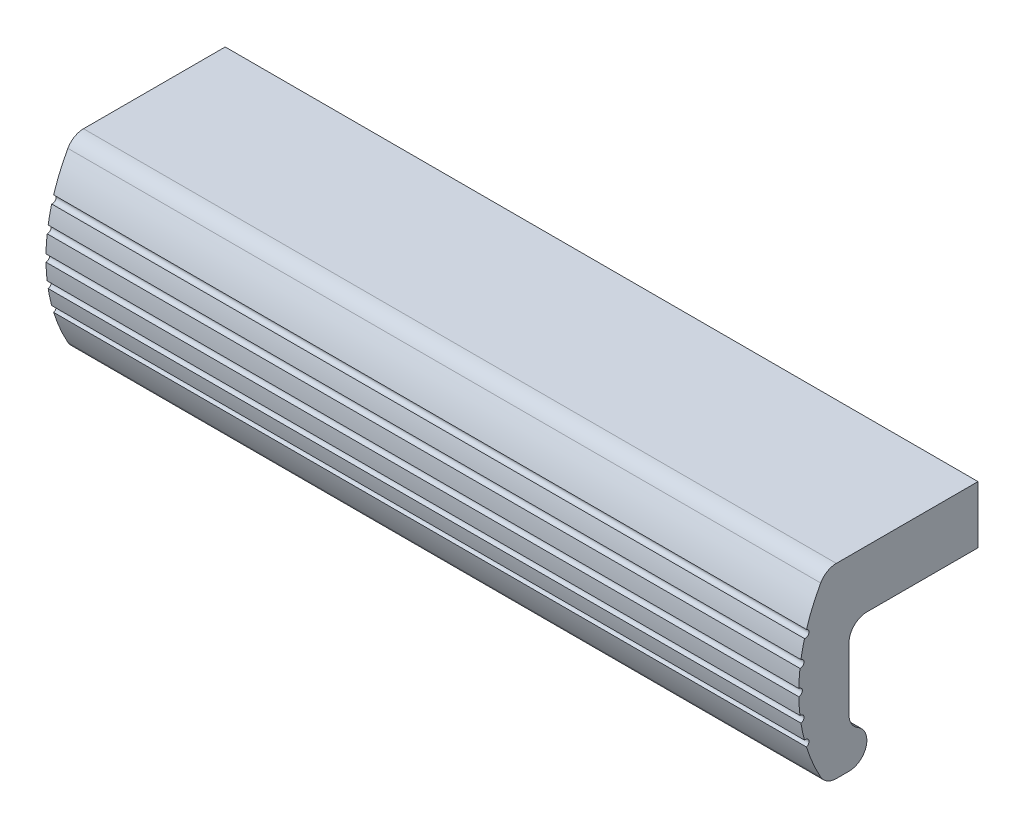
ISO-10303-21;
HEADER;
FILE_DESCRIPTION(('STEP AP214'),'2;1');
FILE_NAME('part.step','',(''),(''),'','','');
FILE_SCHEMA(('AUTOMOTIVE_DESIGN { 1 0 10303 214 1 1 1 1 }'));
ENDSEC;
DATA;
#1=APPLICATION_CONTEXT('core data for automotive mechanical design processes');
#2=APPLICATION_PROTOCOL_DEFINITION('international standard','automotive_design',2000,#1);
#3=PRODUCT_CONTEXT('',#1,'mechanical');
#4=PRODUCT('Part','Part','',(#3));
#5=PRODUCT_RELATED_PRODUCT_CATEGORY('part','',(#4));
#6=PRODUCT_DEFINITION_FORMATION('','',#4);
#7=PRODUCT_DEFINITION_CONTEXT('part definition',#1,'design');
#8=PRODUCT_DEFINITION('design','',#6,#7);
#9=PRODUCT_DEFINITION_SHAPE('','',#8);
#10=(LENGTH_UNIT() NAMED_UNIT(*) SI_UNIT(.MILLI.,.METRE.));
#11=(NAMED_UNIT(*) PLANE_ANGLE_UNIT() SI_UNIT($,.RADIAN.));
#12=(NAMED_UNIT(*) SI_UNIT($,.STERADIAN.) SOLID_ANGLE_UNIT());
#13=UNCERTAINTY_MEASURE_WITH_UNIT(LENGTH_MEASURE(1.E-05),#10,'distance_accuracy_value','');
#14=(GEOMETRIC_REPRESENTATION_CONTEXT(3) GLOBAL_UNCERTAINTY_ASSIGNED_CONTEXT((#13)) GLOBAL_UNIT_ASSIGNED_CONTEXT((#10,
#11,#12)) REPRESENTATION_CONTEXT('',''));
#15=CARTESIAN_POINT('',(0.,0.,0.));
#16=DIRECTION('',(0.,0.,1.));
#17=DIRECTION('',(1.,0.,0.));
#18=AXIS2_PLACEMENT_3D('',#15,#16,#17);
#19=CARTESIAN_POINT('',(-7.5,-4.,0.));
#20=DIRECTION('',(0.,1.,0.));
#21=DIRECTION('',(-1.,0.,0.));
#22=AXIS2_PLACEMENT_3D('',#19,#20,#21);
#23=PLANE('',#22);
#24=DIRECTION('',(1.,0.,0.));
#25=VECTOR('',#24,1.);
#26=CARTESIAN_POINT('',(-7.5,-4.,15.5));
#27=LINE('',#26,#25);
#28=CARTESIAN_POINT('',(-7.5,-4.,15.5));
#29=VERTEX_POINT('',#28);
#30=CARTESIAN_POINT('',(97.5,-4.,15.5));
#31=VERTEX_POINT('',#30);
#32=EDGE_CURVE('E9',#29,#31,#27,.T.);
#33=ORIENTED_EDGE('',*,*,#32,.F.);
#34=DIRECTION('',(0.,0.,1.));
#35=VECTOR('',#34,1.);
#36=CARTESIAN_POINT('',(-7.5,-4.,0.));
#37=LINE('',#36,#35);
#38=CARTESIAN_POINT('',(-7.5,-4.,0.));
#39=VERTEX_POINT('',#38);
#40=EDGE_CURVE('E232',#39,#29,#37,.T.);
#41=ORIENTED_EDGE('',*,*,#40,.F.);
#42=DIRECTION('',(1.,0.,0.));
#43=VECTOR('',#42,1.);
#44=CARTESIAN_POINT('',(-7.5,-4.,0.));
#45=LINE('',#44,#43);
#46=CARTESIAN_POINT('',(97.5,-4.,0.));
#47=VERTEX_POINT('',#46);
#48=EDGE_CURVE('E29',#39,#47,#45,.T.);
#49=ORIENTED_EDGE('',*,*,#48,.T.);
#50=DIRECTION('',(0.,0.,1.));
#51=VECTOR('',#50,1.);
#52=CARTESIAN_POINT('',(97.5,-4.,0.));
#53=LINE('',#52,#51);
#54=EDGE_CURVE('E167',#47,#31,#53,.T.);
#55=ORIENTED_EDGE('',*,*,#54,.T.);
#56=EDGE_LOOP('',(#33,#41,#49,#55));
#57=FACE_BOUND('',#56,.T.);
#58=ADVANCED_FACE('F14',(#57),#23,.F.);
#59=CARTESIAN_POINT('',(-7.5,-6.5,15.5));
#60=DIRECTION('',(1.,0.,0.));
#61=DIRECTION('',(0.,0.,-1.));
#62=AXIS2_PLACEMENT_3D('',#59,#60,#61);
#63=CYLINDRICAL_SURFACE('',#62,2.5);
#64=DIRECTION('',(1.,0.,0.));
#65=VECTOR('',#64,1.);
#66=CARTESIAN_POINT('',(-7.5,-6.5,18.));
#67=LINE('',#66,#65);
#68=CARTESIAN_POINT('',(-7.5,-6.5,18.));
#69=VERTEX_POINT('',#68);
#70=CARTESIAN_POINT('',(97.5,-6.5,18.));
#71=VERTEX_POINT('',#70);
#72=EDGE_CURVE('E22',#69,#71,#67,.T.);
#73=ORIENTED_EDGE('',*,*,#72,.F.);
#74=CARTESIAN_POINT('',(-7.5,-6.5,15.5));
#75=DIRECTION('',(-1.,0.,0.));
#76=DIRECTION('',(0.,0.,1.));
#77=AXIS2_PLACEMENT_3D('',#74,#75,#76);
#78=CIRCLE('',#77,2.5);
#79=EDGE_CURVE('E163',#69,#29,#78,.T.);
#80=ORIENTED_EDGE('',*,*,#79,.T.);
#81=ORIENTED_EDGE('',*,*,#32,.T.);
#82=CARTESIAN_POINT('',(97.5,-6.5,15.5));
#83=DIRECTION('',(-1.,0.,0.));
#84=DIRECTION('',(0.,0.,1.));
#85=AXIS2_PLACEMENT_3D('',#82,#83,#84);
#86=CIRCLE('',#85,2.5);
#87=EDGE_CURVE('E160',#71,#31,#86,.T.);
#88=ORIENTED_EDGE('',*,*,#87,.F.);
#89=EDGE_LOOP('',(#73,#80,#81,#88));
#90=FACE_BOUND('',#89,.T.);
#91=ADVANCED_FACE('F16',(#90),#63,.F.);
#92=CARTESIAN_POINT('',(-7.5,-6.5,18.));
#93=DIRECTION('',(0.,0.,1.));
#94=DIRECTION('',(1.,0.,0.));
#95=AXIS2_PLACEMENT_3D('',#92,#93,#94);
#96=PLANE('',#95);
#97=DIRECTION('',(1.,0.,0.));
#98=VECTOR('',#97,1.);
#99=CARTESIAN_POINT('',(-7.5,-15.1698729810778,18.));
#100=LINE('',#99,#98);
#101=CARTESIAN_POINT('',(-7.5,-15.1698729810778,18.));
#102=VERTEX_POINT('',#101);
#103=CARTESIAN_POINT('',(97.5,-15.1698729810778,18.));
#104=VERTEX_POINT('',#103);
#105=EDGE_CURVE('E324',#102,#104,#100,.T.);
#106=ORIENTED_EDGE('',*,*,#105,.F.);
#107=DIRECTION('',(0.,-1.,0.));
#108=VECTOR('',#107,1.);
#109=CARTESIAN_POINT('',(-7.5,-6.5,18.));
#110=LINE('',#109,#108);
#111=EDGE_CURVE('E235',#69,#102,#110,.T.);
#112=ORIENTED_EDGE('',*,*,#111,.F.);
#113=ORIENTED_EDGE('',*,*,#72,.T.);
#114=DIRECTION('',(0.,-1.,0.));
#115=VECTOR('',#114,1.);
#116=CARTESIAN_POINT('',(97.5,-6.5,18.));
#117=LINE('',#116,#115);
#118=EDGE_CURVE('E175',#71,#104,#117,.T.);
#119=ORIENTED_EDGE('',*,*,#118,.T.);
#120=EDGE_LOOP('',(#106,#112,#113,#119));
#121=FACE_BOUND('',#120,.T.);
#122=ADVANCED_FACE('F327',(#121),#96,.F.);
#123=CARTESIAN_POINT('',(-7.5,-15.1698729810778,15.5));
#124=DIRECTION('',(1.,0.,0.));
#125=DIRECTION('',(0.,0.,-1.));
#126=AXIS2_PLACEMENT_3D('',#123,#124,#125);
#127=CYLINDRICAL_SURFACE('',#126,2.5);
#128=DIRECTION('',(1.,0.,0.));
#129=VECTOR('',#128,1.);
#130=CARTESIAN_POINT('',(-7.5,-17.334936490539,16.75));
#131=LINE('',#130,#129);
#132=CARTESIAN_POINT('',(-7.5,-17.334936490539,16.75));
#133=VERTEX_POINT('',#132);
#134=CARTESIAN_POINT('',(97.5,-17.334936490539,16.75));
#135=VERTEX_POINT('',#134);
#136=EDGE_CURVE('E322',#133,#135,#131,.T.);
#137=ORIENTED_EDGE('',*,*,#136,.F.);
#138=CARTESIAN_POINT('',(-7.5,-15.1698729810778,15.5));
#139=DIRECTION('',(-1.,0.,0.));
#140=DIRECTION('',(0.,0.,1.));
#141=AXIS2_PLACEMENT_3D('',#138,#139,#140);
#142=CIRCLE('',#141,2.5);
#143=EDGE_CURVE('E238',#133,#102,#142,.T.);
#144=ORIENTED_EDGE('',*,*,#143,.T.);
#145=ORIENTED_EDGE('',*,*,#105,.T.);
#146=CARTESIAN_POINT('',(97.5,-15.1698729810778,15.5));
#147=DIRECTION('',(-1.,0.,0.));
#148=DIRECTION('',(0.,0.,1.));
#149=AXIS2_PLACEMENT_3D('',#146,#147,#148);
#150=CIRCLE('',#149,2.5);
#151=EDGE_CURVE('E177',#135,#104,#150,.T.);
#152=ORIENTED_EDGE('',*,*,#151,.F.);
#153=EDGE_LOOP('',(#137,#144,#145,#152));
#154=FACE_BOUND('',#153,.T.);
#155=ADVANCED_FACE('F396',(#154),#127,.F.);
#156=CARTESIAN_POINT('',(-7.5,-19.5,18.));
#157=DIRECTION('',(1.,0.,0.));
#158=DIRECTION('',(0.,0.,-1.));
#159=AXIS2_PLACEMENT_3D('',#156,#157,#158);
#160=CYLINDRICAL_SURFACE('',#159,2.5);
#161=DIRECTION('',(1.,0.,0.));
#162=VECTOR('',#161,1.);
#163=CARTESIAN_POINT('',(-7.5,-22.,18.));
#164=LINE('',#163,#162);
#165=CARTESIAN_POINT('',(-7.5,-22.,18.));
#166=VERTEX_POINT('',#165);
#167=CARTESIAN_POINT('',(97.5,-22.,18.));
#168=VERTEX_POINT('',#167);
#169=EDGE_CURVE('E320',#166,#168,#164,.T.);
#170=ORIENTED_EDGE('',*,*,#169,.F.);
#171=CARTESIAN_POINT('',(-7.5,-19.5,18.));
#172=DIRECTION('',(-1.,0.,0.));
#173=DIRECTION('',(0.,0.,1.));
#174=AXIS2_PLACEMENT_3D('',#171,#172,#173);
#175=CIRCLE('',#174,2.5);
#176=EDGE_CURVE('E241',#133,#166,#175,.T.);
#177=ORIENTED_EDGE('',*,*,#176,.F.);
#178=ORIENTED_EDGE('',*,*,#136,.T.);
#179=CARTESIAN_POINT('',(97.5,-19.5,18.));
#180=DIRECTION('',(-1.,0.,0.));
#181=DIRECTION('',(0.,0.,1.));
#182=AXIS2_PLACEMENT_3D('',#179,#180,#181);
#183=CIRCLE('',#182,2.5);
#184=EDGE_CURVE('E182',#135,#168,#183,.T.);
#185=ORIENTED_EDGE('',*,*,#184,.T.);
#186=EDGE_LOOP('',(#170,#177,#178,#185));
#187=FACE_BOUND('',#186,.T.);
#188=ADVANCED_FACE('F393',(#187),#160,.T.);
#189=CARTESIAN_POINT('',(-7.5,-22.,18.));
#190=DIRECTION('',(0.,1.,0.));
#191=DIRECTION('',(-1.,0.,0.));
#192=AXIS2_PLACEMENT_3D('',#189,#190,#191);
#193=PLANE('',#192);
#194=DIRECTION('',(1.,0.,0.));
#195=VECTOR('',#194,1.);
#196=CARTESIAN_POINT('',(-7.5,-22.,19.7616630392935));
#197=LINE('',#196,#195);
#198=CARTESIAN_POINT('',(-7.5,-22.,19.7616630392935));
#199=VERTEX_POINT('',#198);
#200=CARTESIAN_POINT('',(97.5,-22.,19.7616630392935));
#201=VERTEX_POINT('',#200);
#202=EDGE_CURVE('E318',#199,#201,#197,.T.);
#203=ORIENTED_EDGE('',*,*,#202,.F.);
#204=DIRECTION('',(0.,0.,1.));
#205=VECTOR('',#204,1.);
#206=CARTESIAN_POINT('',(-7.5,-22.,18.));
#207=LINE('',#206,#205);
#208=EDGE_CURVE('E244',#166,#199,#207,.T.);
#209=ORIENTED_EDGE('',*,*,#208,.F.);
#210=ORIENTED_EDGE('',*,*,#169,.T.);
#211=DIRECTION('',(0.,0.,1.));
#212=VECTOR('',#211,1.);
#213=CARTESIAN_POINT('',(97.5,-22.,18.));
#214=LINE('',#213,#212);
#215=EDGE_CURVE('E185',#168,#201,#214,.T.);
#216=ORIENTED_EDGE('',*,*,#215,.T.);
#217=EDGE_LOOP('',(#203,#209,#210,#216));
#218=FACE_BOUND('',#217,.T.);
#219=ADVANCED_FACE('F390',(#218),#193,.F.);
#220=CARTESIAN_POINT('',(-7.5,-19.5,19.7616630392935));
#221=DIRECTION('',(1.,0.,0.));
#222=DIRECTION('',(0.,0.,-1.));
#223=AXIS2_PLACEMENT_3D('',#220,#221,#222);
#224=CYLINDRICAL_SURFACE('',#223,2.5);
#225=DIRECTION('',(1.,0.,0.));
#226=VECTOR('',#225,1.);
#227=CARTESIAN_POINT('',(-7.5,-20.720930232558,21.943251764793));
#228=LINE('',#227,#226);
#229=CARTESIAN_POINT('',(-7.5,-20.720930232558,21.943251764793));
#230=VERTEX_POINT('',#229);
#231=CARTESIAN_POINT('',(97.5,-20.720930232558,21.943251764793));
#232=VERTEX_POINT('',#231);
#233=EDGE_CURVE('E316',#230,#232,#228,.T.);
#234=ORIENTED_EDGE('',*,*,#233,.F.);
#235=CARTESIAN_POINT('',(-7.5,-19.5,19.7616630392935));
#236=DIRECTION('',(-1.,0.,0.));
#237=DIRECTION('',(0.,0.,1.));
#238=AXIS2_PLACEMENT_3D('',#235,#236,#237);
#239=CIRCLE('',#238,2.5);
#240=EDGE_CURVE('E247',#199,#230,#239,.T.);
#241=ORIENTED_EDGE('',*,*,#240,.F.);
#242=ORIENTED_EDGE('',*,*,#202,.T.);
#243=CARTESIAN_POINT('',(97.5,-19.5,19.7616630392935));
#244=DIRECTION('',(-1.,0.,0.));
#245=DIRECTION('',(0.,0.,1.));
#246=AXIS2_PLACEMENT_3D('',#243,#244,#245);
#247=CIRCLE('',#246,2.5);
#248=EDGE_CURVE('E188',#201,#232,#247,.T.);
#249=ORIENTED_EDGE('',*,*,#248,.T.);
#250=EDGE_LOOP('',(#234,#241,#242,#249));
#251=FACE_BOUND('',#250,.T.);
#252=ADVANCED_FACE('F386',(#251),#224,.T.);
#253=CARTESIAN_POINT('',(-7.5,-9.,1.));
#254=DIRECTION('',(1.,0.,0.));
#255=DIRECTION('',(0.,0.,-1.));
#256=AXIS2_PLACEMENT_3D('',#253,#254,#255);
#257=CYLINDRICAL_SURFACE('',#256,24.);
#258=DIRECTION('',(1.,0.,0.));
#259=VECTOR('',#258,1.);
#260=CARTESIAN_POINT('',(-7.5,-16.094465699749,23.9274629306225));
#261=LINE('',#260,#259);
#262=CARTESIAN_POINT('',(-7.5,-16.094465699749,23.9274629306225));
#263=VERTEX_POINT('',#262);
#264=CARTESIAN_POINT('',(97.5,-16.094465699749,23.9274629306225));
#265=VERTEX_POINT('',#264);
#266=EDGE_CURVE('E314',#263,#265,#261,.T.);
#267=ORIENTED_EDGE('',*,*,#266,.F.);
#268=CARTESIAN_POINT('',(-7.5,-9.,1.));
#269=DIRECTION('',(-1.,0.,0.));
#270=DIRECTION('',(0.,0.,1.));
#271=AXIS2_PLACEMENT_3D('',#268,#269,#270);
#272=CIRCLE('',#271,24.);
#273=EDGE_CURVE('E250',#230,#263,#272,.T.);
#274=ORIENTED_EDGE('',*,*,#273,.F.);
#275=ORIENTED_EDGE('',*,*,#233,.T.);
#276=CARTESIAN_POINT('',(97.5,-9.,1.));
#277=DIRECTION('',(-1.,0.,0.));
#278=DIRECTION('',(0.,0.,1.));
#279=AXIS2_PLACEMENT_3D('',#276,#277,#278);
#280=CIRCLE('',#279,24.);
#281=EDGE_CURVE('E191',#232,#265,#280,.T.);
#282=ORIENTED_EDGE('',*,*,#281,.T.);
#283=EDGE_LOOP('',(#267,#274,#275,#282));
#284=FACE_BOUND('',#283,.T.);
#285=ADVANCED_FACE('F381',(#284),#257,.T.);
#286=CARTESIAN_POINT('',(-7.5,-15.615296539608,24.0702807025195));
#287=DIRECTION('',(1.,0.,0.));
#288=DIRECTION('',(0.,0.,-1.));
#289=AXIS2_PLACEMENT_3D('',#286,#287,#288);
#290=CYLINDRICAL_SURFACE('',#289,0.5);
#291=DIRECTION('',(1.,0.,0.));
#292=VECTOR('',#291,1.);
#293=CARTESIAN_POINT('',(-7.5,-15.1332561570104,24.2030853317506));
#294=LINE('',#293,#292);
#295=CARTESIAN_POINT('',(-7.5,-15.1332561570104,24.2030853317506));
#296=VERTEX_POINT('',#295);
#297=CARTESIAN_POINT('',(97.5,-15.1332561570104,24.2030853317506));
#298=VERTEX_POINT('',#297);
#299=EDGE_CURVE('E312',#296,#298,#294,.T.);
#300=ORIENTED_EDGE('',*,*,#299,.F.);
#301=CARTESIAN_POINT('',(-7.5,-15.615296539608,24.0702807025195));
#302=DIRECTION('',(-1.,0.,0.));
#303=DIRECTION('',(0.,0.,1.));
#304=AXIS2_PLACEMENT_3D('',#301,#302,#303);
#305=CIRCLE('',#304,0.5);
#306=EDGE_CURVE('E253',#296,#263,#305,.T.);
#307=ORIENTED_EDGE('',*,*,#306,.T.);
#308=ORIENTED_EDGE('',*,*,#266,.T.);
#309=CARTESIAN_POINT('',(97.5,-15.615296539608,24.0702807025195));
#310=DIRECTION('',(-1.,0.,0.));
#311=DIRECTION('',(0.,0.,1.));
#312=AXIS2_PLACEMENT_3D('',#309,#310,#311);
#313=CIRCLE('',#312,0.5);
#314=EDGE_CURVE('E194',#298,#265,#313,.T.);
#315=ORIENTED_EDGE('',*,*,#314,.F.);
#316=EDGE_LOOP('',(#300,#307,#308,#315));
#317=FACE_BOUND('',#316,.T.);
#318=ADVANCED_FACE('F378',(#317),#290,.F.);
#319=CARTESIAN_POINT('',(-7.5,-9.,1.));
#320=DIRECTION('',(1.,0.,0.));
#321=DIRECTION('',(0.,0.,-1.));
#322=AXIS2_PLACEMENT_3D('',#319,#320,#321);
#323=CYLINDRICAL_SURFACE('',#322,24.);
#324=DIRECTION('',(1.,0.,0.));
#325=VECTOR('',#324,1.);
#326=CARTESIAN_POINT('',(-7.5,-12.8345367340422,24.6916932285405));
#327=LINE('',#326,#325);
#328=CARTESIAN_POINT('',(-7.5,-12.8345367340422,24.6916932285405));
#329=VERTEX_POINT('',#328);
#330=CARTESIAN_POINT('',(97.5,-12.8345367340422,24.6916932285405));
#331=VERTEX_POINT('',#330);
#332=EDGE_CURVE('E310',#329,#331,#327,.T.);
#333=ORIENTED_EDGE('',*,*,#332,.F.);
#334=CARTESIAN_POINT('',(-7.5,-9.,1.));
#335=DIRECTION('',(-1.,0.,0.));
#336=DIRECTION('',(0.,0.,1.));
#337=AXIS2_PLACEMENT_3D('',#334,#335,#336);
#338=CIRCLE('',#337,24.);
#339=EDGE_CURVE('E256',#296,#329,#338,.T.);
#340=ORIENTED_EDGE('',*,*,#339,.F.);
#341=ORIENTED_EDGE('',*,*,#299,.T.);
#342=CARTESIAN_POINT('',(97.5,-9.,1.));
#343=DIRECTION('',(-1.,0.,0.));
#344=DIRECTION('',(0.,0.,1.));
#345=AXIS2_PLACEMENT_3D('',#342,#343,#344);
#346=CIRCLE('',#345,24.);
#347=EDGE_CURVE('E197',#298,#331,#346,.T.);
#348=ORIENTED_EDGE('',*,*,#347,.T.);
#349=EDGE_LOOP('',(#333,#340,#341,#348));
#350=FACE_BOUND('',#349,.T.);
#351=ADVANCED_FACE('F374',(#350),#323,.T.);
#352=CARTESIAN_POINT('',(-7.5,-12.3401544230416,24.7664336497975));
#353=DIRECTION('',(1.,0.,0.));
#354=DIRECTION('',(0.,0.,-1.));
#355=AXIS2_PLACEMENT_3D('',#352,#353,#354);
#356=CYLINDRICAL_SURFACE('',#355,0.5);
#357=DIRECTION('',(1.,0.,0.));
#358=VECTOR('',#357,1.);
#359=CARTESIAN_POINT('',(-7.5,-11.8443223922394,24.830858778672));
#360=LINE('',#359,#358);
#361=CARTESIAN_POINT('',(-7.5,-11.8443223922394,24.830858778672));
#362=VERTEX_POINT('',#361);
#363=CARTESIAN_POINT('',(97.5,-11.8443223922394,24.830858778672));
#364=VERTEX_POINT('',#363);
#365=EDGE_CURVE('E308',#362,#364,#360,.T.);
#366=ORIENTED_EDGE('',*,*,#365,.F.);
#367=CARTESIAN_POINT('',(-7.5,-12.3401544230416,24.7664336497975));
#368=DIRECTION('',(-1.,0.,0.));
#369=DIRECTION('',(0.,0.,1.));
#370=AXIS2_PLACEMENT_3D('',#367,#368,#369);
#371=CIRCLE('',#370,0.5);
#372=EDGE_CURVE('E259',#362,#329,#371,.T.);
#373=ORIENTED_EDGE('',*,*,#372,.T.);
#374=ORIENTED_EDGE('',*,*,#332,.T.);
#375=CARTESIAN_POINT('',(97.5,-12.3401544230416,24.7664336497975));
#376=DIRECTION('',(-1.,0.,0.));
#377=DIRECTION('',(0.,0.,1.));
#378=AXIS2_PLACEMENT_3D('',#375,#376,#377);
#379=CIRCLE('',#378,0.5);
#380=EDGE_CURVE('E200',#364,#331,#379,.T.);
#381=ORIENTED_EDGE('',*,*,#380,.F.);
#382=EDGE_LOOP('',(#366,#373,#374,#381));
#383=FACE_BOUND('',#382,.T.);
#384=ADVANCED_FACE('F369',(#383),#356,.F.);
#385=CARTESIAN_POINT('',(-7.5,-9.,1.));
#386=DIRECTION('',(1.,0.,0.));
#387=DIRECTION('',(0.,0.,-1.));
#388=AXIS2_PLACEMENT_3D('',#385,#386,#387);
#389=CYLINDRICAL_SURFACE('',#388,24.);
#390=DIRECTION('',(1.,0.,0.));
#391=VECTOR('',#390,1.);
#392=CARTESIAN_POINT('',(-7.5,-9.49997287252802,24.9947916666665));
#393=LINE('',#392,#391);
#394=CARTESIAN_POINT('',(-7.5,-9.49997287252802,24.9947916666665));
#395=VERTEX_POINT('',#394);
#396=CARTESIAN_POINT('',(97.5,-9.49997287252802,24.9947916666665));
#397=VERTEX_POINT('',#396);
#398=EDGE_CURVE('E306',#395,#397,#393,.T.);
#399=ORIENTED_EDGE('',*,*,#398,.F.);
#400=CARTESIAN_POINT('',(-7.5,-9.,1.));
#401=DIRECTION('',(-1.,0.,0.));
#402=DIRECTION('',(0.,0.,1.));
#403=AXIS2_PLACEMENT_3D('',#400,#401,#402);
#404=CIRCLE('',#403,24.);
#405=EDGE_CURVE('E262',#362,#395,#404,.T.);
#406=ORIENTED_EDGE('',*,*,#405,.F.);
#407=ORIENTED_EDGE('',*,*,#365,.T.);
#408=CARTESIAN_POINT('',(97.5,-9.,1.));
#409=DIRECTION('',(-1.,0.,0.));
#410=DIRECTION('',(0.,0.,1.));
#411=AXIS2_PLACEMENT_3D('',#408,#409,#410);
#412=CIRCLE('',#411,24.);
#413=EDGE_CURVE('E203',#364,#397,#412,.T.);
#414=ORIENTED_EDGE('',*,*,#413,.T.);
#415=EDGE_LOOP('',(#399,#406,#407,#414));
#416=FACE_BOUND('',#415,.T.);
#417=ADVANCED_FACE('F365',(#416),#389,.T.);
#418=CARTESIAN_POINT('',(-7.5,-9.,25.));
#419=DIRECTION('',(1.,0.,0.));
#420=DIRECTION('',(0.,0.,-1.));
#421=AXIS2_PLACEMENT_3D('',#418,#419,#420);
#422=CYLINDRICAL_SURFACE('',#421,0.500000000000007);
#423=DIRECTION('',(1.,0.,0.));
#424=VECTOR('',#423,1.);
#425=CARTESIAN_POINT('',(-7.5,-8.50002712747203,24.9947916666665));
#426=LINE('',#425,#424);
#427=CARTESIAN_POINT('',(-7.5,-8.50002712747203,24.9947916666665));
#428=VERTEX_POINT('',#427);
#429=CARTESIAN_POINT('',(97.5,-8.50002712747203,24.9947916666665));
#430=VERTEX_POINT('',#429);
#431=EDGE_CURVE('E304',#428,#430,#426,.T.);
#432=ORIENTED_EDGE('',*,*,#431,.F.);
#433=CARTESIAN_POINT('',(-7.5,-9.,25.));
#434=DIRECTION('',(-1.,0.,0.));
#435=DIRECTION('',(0.,0.,1.));
#436=AXIS2_PLACEMENT_3D('',#433,#434,#435);
#437=CIRCLE('',#436,0.500000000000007);
#438=EDGE_CURVE('E265',#428,#395,#437,.T.);
#439=ORIENTED_EDGE('',*,*,#438,.T.);
#440=ORIENTED_EDGE('',*,*,#398,.T.);
#441=CARTESIAN_POINT('',(97.5,-9.,25.));
#442=DIRECTION('',(-1.,0.,0.));
#443=DIRECTION('',(0.,0.,1.));
#444=AXIS2_PLACEMENT_3D('',#441,#442,#443);
#445=CIRCLE('',#444,0.500000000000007);
#446=EDGE_CURVE('E206',#430,#397,#445,.T.);
#447=ORIENTED_EDGE('',*,*,#446,.F.);
#448=EDGE_LOOP('',(#432,#439,#440,#447));
#449=FACE_BOUND('',#448,.T.);
#450=ADVANCED_FACE('F361',(#449),#422,.F.);
#451=CARTESIAN_POINT('',(-7.5,-9.,1.));
#452=DIRECTION('',(1.,0.,0.));
#453=DIRECTION('',(0.,0.,-1.));
#454=AXIS2_PLACEMENT_3D('',#451,#452,#453);
#455=CYLINDRICAL_SURFACE('',#454,24.);
#456=DIRECTION('',(1.,0.,0.));
#457=VECTOR('',#456,1.);
#458=CARTESIAN_POINT('',(-7.5,-6.15567760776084,24.830858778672));
#459=LINE('',#458,#457);
#460=CARTESIAN_POINT('',(-7.5,-6.15567760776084,24.830858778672));
#461=VERTEX_POINT('',#460);
#462=CARTESIAN_POINT('',(97.5,-6.15567760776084,24.830858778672));
#463=VERTEX_POINT('',#462);
#464=EDGE_CURVE('E302',#461,#463,#459,.T.);
#465=ORIENTED_EDGE('',*,*,#464,.F.);
#466=CARTESIAN_POINT('',(-7.5,-9.,1.));
#467=DIRECTION('',(-1.,0.,0.));
#468=DIRECTION('',(0.,0.,1.));
#469=AXIS2_PLACEMENT_3D('',#466,#467,#468);
#470=CIRCLE('',#469,24.);
#471=EDGE_CURVE('E268',#428,#461,#470,.T.);
#472=ORIENTED_EDGE('',*,*,#471,.F.);
#473=ORIENTED_EDGE('',*,*,#431,.T.);
#474=CARTESIAN_POINT('',(97.5,-9.,1.));
#475=DIRECTION('',(-1.,0.,0.));
#476=DIRECTION('',(0.,0.,1.));
#477=AXIS2_PLACEMENT_3D('',#474,#475,#476);
#478=CIRCLE('',#477,24.);
#479=EDGE_CURVE('E209',#430,#463,#478,.T.);
#480=ORIENTED_EDGE('',*,*,#479,.T.);
#481=EDGE_LOOP('',(#465,#472,#473,#480));
#482=FACE_BOUND('',#481,.T.);
#483=ADVANCED_FACE('F357',(#482),#455,.T.);
#484=CARTESIAN_POINT('',(-7.5,-5.65984557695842,24.7664336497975));
#485=DIRECTION('',(1.,0.,0.));
#486=DIRECTION('',(0.,0.,-1.));
#487=AXIS2_PLACEMENT_3D('',#484,#485,#486);
#488=CYLINDRICAL_SURFACE('',#487,0.499999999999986);
#489=DIRECTION('',(1.,0.,0.));
#490=VECTOR('',#489,1.);
#491=CARTESIAN_POINT('',(-7.5,-5.16546326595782,24.6916932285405));
#492=LINE('',#491,#490);
#493=CARTESIAN_POINT('',(-7.5,-5.16546326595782,24.6916932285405));
#494=VERTEX_POINT('',#493);
#495=CARTESIAN_POINT('',(97.5,-5.16546326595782,24.6916932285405));
#496=VERTEX_POINT('',#495);
#497=EDGE_CURVE('E300',#494,#496,#492,.T.);
#498=ORIENTED_EDGE('',*,*,#497,.F.);
#499=CARTESIAN_POINT('',(-7.5,-5.65984557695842,24.7664336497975));
#500=DIRECTION('',(-1.,0.,0.));
#501=DIRECTION('',(0.,0.,1.));
#502=AXIS2_PLACEMENT_3D('',#499,#500,#501);
#503=CIRCLE('',#502,0.499999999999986);
#504=EDGE_CURVE('E271',#494,#461,#503,.T.);
#505=ORIENTED_EDGE('',*,*,#504,.T.);
#506=ORIENTED_EDGE('',*,*,#464,.T.);
#507=CARTESIAN_POINT('',(97.5,-5.65984557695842,24.7664336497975));
#508=DIRECTION('',(-1.,0.,0.));
#509=DIRECTION('',(0.,0.,1.));
#510=AXIS2_PLACEMENT_3D('',#507,#508,#509);
#511=CIRCLE('',#510,0.499999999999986);
#512=EDGE_CURVE('E212',#496,#463,#511,.T.);
#513=ORIENTED_EDGE('',*,*,#512,.F.);
#514=EDGE_LOOP('',(#498,#505,#506,#513));
#515=FACE_BOUND('',#514,.T.);
#516=ADVANCED_FACE('F354',(#515),#488,.F.);
#517=CARTESIAN_POINT('',(-7.5,-9.,1.));
#518=DIRECTION('',(1.,0.,0.));
#519=DIRECTION('',(0.,0.,-1.));
#520=AXIS2_PLACEMENT_3D('',#517,#518,#519);
#521=CYLINDRICAL_SURFACE('',#520,24.);
#522=DIRECTION('',(1.,0.,0.));
#523=VECTOR('',#522,1.);
#524=CARTESIAN_POINT('',(-7.5,-2.8667438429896,24.2030853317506));
#525=LINE('',#524,#523);
#526=CARTESIAN_POINT('',(-7.5,-2.8667438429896,24.2030853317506));
#527=VERTEX_POINT('',#526);
#528=CARTESIAN_POINT('',(97.5,-2.8667438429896,24.2030853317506));
#529=VERTEX_POINT('',#528);
#530=EDGE_CURVE('E298',#527,#529,#525,.T.);
#531=ORIENTED_EDGE('',*,*,#530,.F.);
#532=CARTESIAN_POINT('',(-7.5,-9.,1.));
#533=DIRECTION('',(-1.,0.,0.));
#534=DIRECTION('',(0.,0.,1.));
#535=AXIS2_PLACEMENT_3D('',#532,#533,#534);
#536=CIRCLE('',#535,24.);
#537=EDGE_CURVE('E274',#494,#527,#536,.T.);
#538=ORIENTED_EDGE('',*,*,#537,.F.);
#539=ORIENTED_EDGE('',*,*,#497,.T.);
#540=CARTESIAN_POINT('',(97.5,-9.,1.));
#541=DIRECTION('',(-1.,0.,0.));
#542=DIRECTION('',(0.,0.,1.));
#543=AXIS2_PLACEMENT_3D('',#540,#541,#542);
#544=CIRCLE('',#543,24.);
#545=EDGE_CURVE('E215',#496,#529,#544,.T.);
#546=ORIENTED_EDGE('',*,*,#545,.T.);
#547=EDGE_LOOP('',(#531,#538,#539,#546));
#548=FACE_BOUND('',#547,.T.);
#549=ADVANCED_FACE('F350',(#548),#521,.T.);
#550=CARTESIAN_POINT('',(-7.5,-2.38470346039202,24.0702807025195));
#551=DIRECTION('',(1.,0.,0.));
#552=DIRECTION('',(0.,0.,-1.));
#553=AXIS2_PLACEMENT_3D('',#550,#551,#552);
#554=CYLINDRICAL_SURFACE('',#553,0.500000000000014);
#555=DIRECTION('',(1.,0.,0.));
#556=VECTOR('',#555,1.);
#557=CARTESIAN_POINT('',(-7.5,-1.90553430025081,23.9274629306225));
#558=LINE('',#557,#556);
#559=CARTESIAN_POINT('',(-7.5,-1.90553430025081,23.9274629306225));
#560=VERTEX_POINT('',#559);
#561=CARTESIAN_POINT('',(97.5,-1.90553430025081,23.9274629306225));
#562=VERTEX_POINT('',#561);
#563=EDGE_CURVE('E296',#560,#562,#558,.T.);
#564=ORIENTED_EDGE('',*,*,#563,.F.);
#565=CARTESIAN_POINT('',(-7.5,-2.38470346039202,24.0702807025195));
#566=DIRECTION('',(-1.,0.,0.));
#567=DIRECTION('',(0.,0.,1.));
#568=AXIS2_PLACEMENT_3D('',#565,#566,#567);
#569=CIRCLE('',#568,0.500000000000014);
#570=EDGE_CURVE('E277',#560,#527,#569,.T.);
#571=ORIENTED_EDGE('',*,*,#570,.T.);
#572=ORIENTED_EDGE('',*,*,#530,.T.);
#573=CARTESIAN_POINT('',(97.5,-2.38470346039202,24.0702807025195));
#574=DIRECTION('',(-1.,0.,0.));
#575=DIRECTION('',(0.,0.,1.));
#576=AXIS2_PLACEMENT_3D('',#573,#574,#575);
#577=CIRCLE('',#576,0.500000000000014);
#578=EDGE_CURVE('E218',#562,#529,#577,.T.);
#579=ORIENTED_EDGE('',*,*,#578,.F.);
#580=EDGE_LOOP('',(#564,#571,#572,#579));
#581=FACE_BOUND('',#580,.T.);
#582=ADVANCED_FACE('F345',(#581),#554,.F.);
#583=CARTESIAN_POINT('',(-7.5,-9.,1.));
#584=DIRECTION('',(1.,0.,0.));
#585=DIRECTION('',(0.,0.,-1.));
#586=AXIS2_PLACEMENT_3D('',#583,#584,#585);
#587=CYLINDRICAL_SURFACE('',#586,24.);
#588=DIRECTION('',(1.,0.,0.));
#589=VECTOR('',#588,1.);
#590=CARTESIAN_POINT('',(-7.5,2.72093023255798,21.943251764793));
#591=LINE('',#590,#589);
#592=CARTESIAN_POINT('',(-7.5,2.72093023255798,21.943251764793));
#593=VERTEX_POINT('',#592);
#594=CARTESIAN_POINT('',(97.5,2.72093023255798,21.943251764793));
#595=VERTEX_POINT('',#594);
#596=EDGE_CURVE('E294',#593,#595,#591,.T.);
#597=ORIENTED_EDGE('',*,*,#596,.F.);
#598=CARTESIAN_POINT('',(-7.5,-9.,1.));
#599=DIRECTION('',(-1.,0.,0.));
#600=DIRECTION('',(0.,0.,1.));
#601=AXIS2_PLACEMENT_3D('',#598,#599,#600);
#602=CIRCLE('',#601,24.);
#603=EDGE_CURVE('E280',#560,#593,#602,.T.);
#604=ORIENTED_EDGE('',*,*,#603,.F.);
#605=ORIENTED_EDGE('',*,*,#563,.T.);
#606=CARTESIAN_POINT('',(97.5,-9.,1.));
#607=DIRECTION('',(-1.,0.,0.));
#608=DIRECTION('',(0.,0.,1.));
#609=AXIS2_PLACEMENT_3D('',#606,#607,#608);
#610=CIRCLE('',#609,24.);
#611=EDGE_CURVE('E221',#562,#595,#610,.T.);
#612=ORIENTED_EDGE('',*,*,#611,.T.);
#613=EDGE_LOOP('',(#597,#604,#605,#612));
#614=FACE_BOUND('',#613,.T.);
#615=ADVANCED_FACE('F341',(#614),#587,.T.);
#616=CARTESIAN_POINT('',(-7.5,1.5,19.7616630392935));
#617=DIRECTION('',(1.,0.,0.));
#618=DIRECTION('',(0.,0.,-1.));
#619=AXIS2_PLACEMENT_3D('',#616,#617,#618);
#620=CYLINDRICAL_SURFACE('',#619,2.5);
#621=DIRECTION('',(1.,0.,0.));
#622=VECTOR('',#621,1.);
#623=CARTESIAN_POINT('',(-7.5,4.,19.7616630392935));
#624=LINE('',#623,#622);
#625=CARTESIAN_POINT('',(-7.5,4.,19.7616630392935));
#626=VERTEX_POINT('',#625);
#627=CARTESIAN_POINT('',(97.5,4.,19.7616630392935));
#628=VERTEX_POINT('',#627);
#629=EDGE_CURVE('E292',#626,#628,#624,.T.);
#630=ORIENTED_EDGE('',*,*,#629,.F.);
#631=CARTESIAN_POINT('',(-7.5,1.5,19.7616630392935));
#632=DIRECTION('',(-1.,0.,0.));
#633=DIRECTION('',(0.,0.,1.));
#634=AXIS2_PLACEMENT_3D('',#631,#632,#633);
#635=CIRCLE('',#634,2.5);
#636=EDGE_CURVE('E283',#593,#626,#635,.T.);
#637=ORIENTED_EDGE('',*,*,#636,.F.);
#638=ORIENTED_EDGE('',*,*,#596,.T.);
#639=CARTESIAN_POINT('',(97.5,1.5,19.7616630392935));
#640=DIRECTION('',(-1.,0.,0.));
#641=DIRECTION('',(0.,0.,1.));
#642=AXIS2_PLACEMENT_3D('',#639,#640,#641);
#643=CIRCLE('',#642,2.5);
#644=EDGE_CURVE('E224',#595,#628,#643,.T.);
#645=ORIENTED_EDGE('',*,*,#644,.T.);
#646=EDGE_LOOP('',(#630,#637,#638,#645));
#647=FACE_BOUND('',#646,.T.);
#648=ADVANCED_FACE('F337',(#647),#620,.T.);
#649=CARTESIAN_POINT('',(-7.5,4.,0.));
#650=DIRECTION('',(0.,1.,0.));
#651=DIRECTION('',(-1.,0.,0.));
#652=AXIS2_PLACEMENT_3D('',#649,#650,#651);
#653=PLANE('',#652);
#654=DIRECTION('',(1.,0.,0.));
#655=VECTOR('',#654,1.);
#656=CARTESIAN_POINT('',(-7.5,4.,0.));
#657=LINE('',#656,#655);
#658=CARTESIAN_POINT('',(-7.5,4.,0.));
#659=VERTEX_POINT('',#658);
#660=CARTESIAN_POINT('',(97.5,4.,0.));
#661=VERTEX_POINT('',#660);
#662=EDGE_CURVE('E37',#659,#661,#657,.T.);
#663=ORIENTED_EDGE('',*,*,#662,.F.);
#664=DIRECTION('',(0.,0.,1.));
#665=VECTOR('',#664,1.);
#666=CARTESIAN_POINT('',(-7.5,4.,0.));
#667=LINE('',#666,#665);
#668=EDGE_CURVE('E286',#659,#626,#667,.T.);
#669=ORIENTED_EDGE('',*,*,#668,.T.);
#670=ORIENTED_EDGE('',*,*,#629,.T.);
#671=DIRECTION('',(0.,0.,1.));
#672=VECTOR('',#671,1.);
#673=CARTESIAN_POINT('',(97.5,4.,0.));
#674=LINE('',#673,#672);
#675=EDGE_CURVE('E227',#661,#628,#674,.T.);
#676=ORIENTED_EDGE('',*,*,#675,.F.);
#677=EDGE_LOOP('',(#663,#669,#670,#676));
#678=FACE_BOUND('',#677,.T.);
#679=ADVANCED_FACE('F333',(#678),#653,.T.);
#680=CARTESIAN_POINT('',(-7.5,-4.,0.));
#681=DIRECTION('',(0.,0.,-1.));
#682=DIRECTION('',(-1.,0.,0.));
#683=AXIS2_PLACEMENT_3D('',#680,#681,#682);
#684=PLANE('',#683);
#685=CARTESIAN_POINT('',(0.,0.,0.));
#686=DIRECTION('',(0.,0.,-1.));
#687=DIRECTION('',(-1.,0.,0.));
#688=AXIS2_PLACEMENT_3D('',#685,#686,#687);
#689=CIRCLE('',#688,2.);
#690=CARTESIAN_POINT('',(-2.,0.,0.));
#691=VERTEX_POINT('',#690);
#692=EDGE_CURVE('E632',#691,#691,#689,.T.);
#693=ORIENTED_EDGE('',*,*,#692,.F.);
#694=EDGE_LOOP('',(#693));
#695=FACE_BOUND('',#694,.T.);
#696=CARTESIAN_POINT('',(90.,0.,0.));
#697=DIRECTION('',(0.,0.,-1.));
#698=DIRECTION('',(-1.,0.,0.));
#699=AXIS2_PLACEMENT_3D('',#696,#697,#698);
#700=CIRCLE('',#699,2.);
#701=CARTESIAN_POINT('',(88.,0.,0.));
#702=VERTEX_POINT('',#701);
#703=EDGE_CURVE('E631',#702,#702,#700,.T.);
#704=ORIENTED_EDGE('',*,*,#703,.F.);
#705=EDGE_LOOP('',(#704));
#706=FACE_BOUND('',#705,.T.);
#707=DIRECTION('',(0.,1.,0.));
#708=VECTOR('',#707,1.);
#709=CARTESIAN_POINT('',(-7.5,-4.,0.));
#710=LINE('',#709,#708);
#711=EDGE_CURVE('E288',#39,#659,#710,.T.);
#712=ORIENTED_EDGE('',*,*,#711,.T.);
#713=ORIENTED_EDGE('',*,*,#662,.T.);
#714=DIRECTION('',(0.,1.,0.));
#715=VECTOR('',#714,1.);
#716=CARTESIAN_POINT('',(97.5,-4.,0.));
#717=LINE('',#716,#715);
#718=EDGE_CURVE('E230',#47,#661,#717,.T.);
#719=ORIENTED_EDGE('',*,*,#718,.F.);
#720=ORIENTED_EDGE('',*,*,#48,.F.);
#721=EDGE_LOOP('',(#712,#713,#719,#720));
#722=FACE_BOUND('',#721,.T.);
#723=ADVANCED_FACE('F332',(#695,#706,#722),#684,.T.);
#724=CARTESIAN_POINT('',(-7.5,-6.5,15.5));
#725=DIRECTION('',(-1.,0.,0.));
#726=DIRECTION('',(0.,0.,1.));
#727=AXIS2_PLACEMENT_3D('',#724,#725,#726);
#728=PLANE('',#727);
#729=ORIENTED_EDGE('',*,*,#40,.T.);
#730=ORIENTED_EDGE('',*,*,#79,.F.);
#731=ORIENTED_EDGE('',*,*,#111,.T.);
#732=ORIENTED_EDGE('',*,*,#143,.F.);
#733=ORIENTED_EDGE('',*,*,#176,.T.);
#734=ORIENTED_EDGE('',*,*,#208,.T.);
#735=ORIENTED_EDGE('',*,*,#240,.T.);
#736=ORIENTED_EDGE('',*,*,#273,.T.);
#737=ORIENTED_EDGE('',*,*,#306,.F.);
#738=ORIENTED_EDGE('',*,*,#339,.T.);
#739=ORIENTED_EDGE('',*,*,#372,.F.);
#740=ORIENTED_EDGE('',*,*,#405,.T.);
#741=ORIENTED_EDGE('',*,*,#438,.F.);
#742=ORIENTED_EDGE('',*,*,#471,.T.);
#743=ORIENTED_EDGE('',*,*,#504,.F.);
#744=ORIENTED_EDGE('',*,*,#537,.T.);
#745=ORIENTED_EDGE('',*,*,#570,.F.);
#746=ORIENTED_EDGE('',*,*,#603,.T.);
#747=ORIENTED_EDGE('',*,*,#636,.T.);
#748=ORIENTED_EDGE('',*,*,#668,.F.);
#749=ORIENTED_EDGE('',*,*,#711,.F.);
#750=EDGE_LOOP('',(#729,#730,#731,#732,#733,#734,#735,#736,#737,#738,#739,#740,#741,#742,#743,
#744,#745,#746,#747,#748,#749));
#751=FACE_BOUND('',#750,.T.);
#752=ADVANCED_FACE('F329',(#751),#728,.T.);
#753=CARTESIAN_POINT('',(97.5,-6.5,15.5));
#754=DIRECTION('',(-1.,0.,0.));
#755=DIRECTION('',(0.,0.,1.));
#756=AXIS2_PLACEMENT_3D('',#753,#754,#755);
#757=PLANE('',#756);
#758=ORIENTED_EDGE('',*,*,#54,.F.);
#759=ORIENTED_EDGE('',*,*,#718,.T.);
#760=ORIENTED_EDGE('',*,*,#675,.T.);
#761=ORIENTED_EDGE('',*,*,#644,.F.);
#762=ORIENTED_EDGE('',*,*,#611,.F.);
#763=ORIENTED_EDGE('',*,*,#578,.T.);
#764=ORIENTED_EDGE('',*,*,#545,.F.);
#765=ORIENTED_EDGE('',*,*,#512,.T.);
#766=ORIENTED_EDGE('',*,*,#479,.F.);
#767=ORIENTED_EDGE('',*,*,#446,.T.);
#768=ORIENTED_EDGE('',*,*,#413,.F.);
#769=ORIENTED_EDGE('',*,*,#380,.T.);
#770=ORIENTED_EDGE('',*,*,#347,.F.);
#771=ORIENTED_EDGE('',*,*,#314,.T.);
#772=ORIENTED_EDGE('',*,*,#281,.F.);
#773=ORIENTED_EDGE('',*,*,#248,.F.);
#774=ORIENTED_EDGE('',*,*,#215,.F.);
#775=ORIENTED_EDGE('',*,*,#184,.F.);
#776=ORIENTED_EDGE('',*,*,#151,.T.);
#777=ORIENTED_EDGE('',*,*,#118,.F.);
#778=ORIENTED_EDGE('',*,*,#87,.T.);
#779=EDGE_LOOP('',(#758,#759,#760,#761,#762,#763,#764,#765,#766,#767,#768,#769,#770,#771,#772,
#773,#774,#775,#776,#777,#778));
#780=FACE_BOUND('',#779,.T.);
#781=ADVANCED_FACE('F172',(#780),#757,.F.);
#782=CARTESIAN_POINT('',(90.,0.,8.));
#783=DIRECTION('',(0.,0.,-1.));
#784=DIRECTION('',(-1.,0.,0.));
#785=AXIS2_PLACEMENT_3D('',#782,#783,#784);
#786=CYLINDRICAL_SURFACE('',#785,2.);
#787=CARTESIAN_POINT('',(90.,0.,8.));
#788=DIRECTION('',(0.,0.,-1.));
#789=DIRECTION('',(-1.,0.,0.));
#790=AXIS2_PLACEMENT_3D('',#787,#788,#789);
#791=CIRCLE('',#790,2.);
#792=CARTESIAN_POINT('',(88.,0.,8.));
#793=VERTEX_POINT('',#792);
#794=EDGE_CURVE('E170',#793,#793,#791,.T.);
#795=ORIENTED_EDGE('',*,*,#794,.F.);
#796=EDGE_LOOP('',(#795));
#797=FACE_BOUND('',#796,.T.);
#798=ORIENTED_EDGE('',*,*,#703,.T.);
#799=EDGE_LOOP('',(#798));
#800=FACE_BOUND('',#799,.T.);
#801=ADVANCED_FACE('F545',(#797,#800),#786,.F.);
#802=CARTESIAN_POINT('',(90.,0.,8.));
#803=DIRECTION('',(0.,0.,-1.));
#804=DIRECTION('',(-1.,0.,0.));
#805=AXIS2_PLACEMENT_3D('',#802,#803,#804);
#806=PLANE('',#805);
#807=ORIENTED_EDGE('',*,*,#794,.T.);
#808=EDGE_LOOP('',(#807));
#809=FACE_BOUND('',#808,.T.);
#810=ADVANCED_FACE('F546',(#809),#806,.T.);
#811=CARTESIAN_POINT('',(0.,0.,8.));
#812=DIRECTION('',(0.,0.,-1.));
#813=DIRECTION('',(-1.,0.,0.));
#814=AXIS2_PLACEMENT_3D('',#811,#812,#813);
#815=CYLINDRICAL_SURFACE('',#814,2.);
#816=CARTESIAN_POINT('',(0.,0.,8.));
#817=DIRECTION('',(0.,0.,-1.));
#818=DIRECTION('',(-1.,0.,0.));
#819=AXIS2_PLACEMENT_3D('',#816,#817,#818);
#820=CIRCLE('',#819,2.);
#821=CARTESIAN_POINT('',(-2.,0.,8.));
#822=VERTEX_POINT('',#821);
#823=EDGE_CURVE('E630',#822,#822,#820,.T.);
#824=ORIENTED_EDGE('',*,*,#823,.F.);
#825=EDGE_LOOP('',(#824));
#826=FACE_BOUND('',#825,.T.);
#827=ORIENTED_EDGE('',*,*,#692,.T.);
#828=EDGE_LOOP('',(#827));
#829=FACE_BOUND('',#828,.T.);
#830=ADVANCED_FACE('F562',(#826,#829),#815,.F.);
#831=CARTESIAN_POINT('',(0.,0.,8.));
#832=DIRECTION('',(0.,0.,-1.));
#833=DIRECTION('',(-1.,0.,0.));
#834=AXIS2_PLACEMENT_3D('',#831,#832,#833);
#835=PLANE('',#834);
#836=ORIENTED_EDGE('',*,*,#823,.T.);
#837=EDGE_LOOP('',(#836));
#838=FACE_BOUND('',#837,.T.);
#839=ADVANCED_FACE('F555',(#838),#835,.T.);
#840=CLOSED_SHELL('',(#58,#91,#122,#155,#188,#219,#252,#285,#318,#351,#384,#417,#450,#483,#516,
#549,#582,#615,#648,#679,#723,#752,#781,#801,#810,#830,#839));
#841=MANIFOLD_SOLID_BREP('B1',#840);
#842=ADVANCED_BREP_SHAPE_REPRESENTATION('',(#18,#841),#14);
#843=SHAPE_DEFINITION_REPRESENTATION(#9,#842);
ENDSEC;
END-ISO-10303-21;
